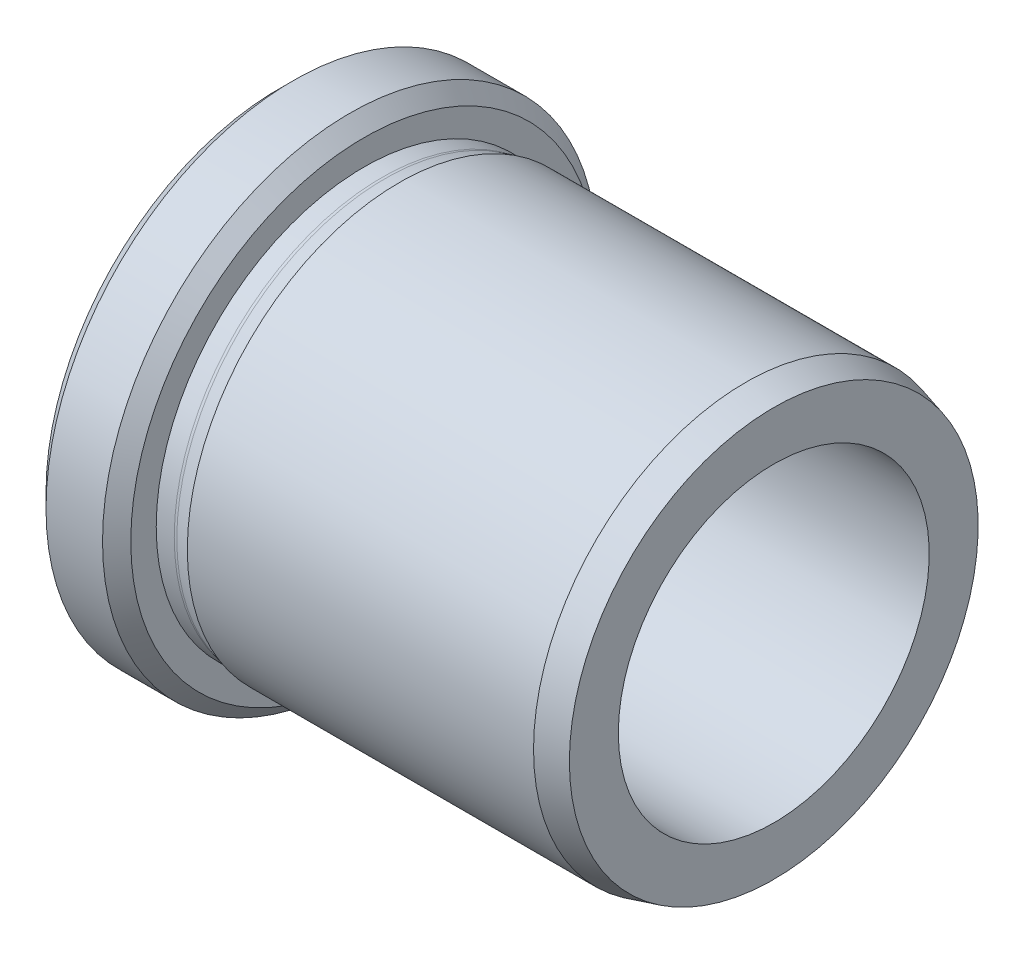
ISO-10303-21;
HEADER;
FILE_DESCRIPTION(('STEP AP214'),'2;1');
FILE_NAME('part.step','',(''),(''),'','','');
FILE_SCHEMA(('AUTOMOTIVE_DESIGN { 1 0 10303 214 1 1 1 1 }'));
ENDSEC;
DATA;
#1=APPLICATION_CONTEXT('core data for automotive mechanical design processes');
#2=APPLICATION_PROTOCOL_DEFINITION('international standard','automotive_design',2000,#1);
#3=PRODUCT_CONTEXT('',#1,'mechanical');
#4=PRODUCT('Part','Part','',(#3));
#5=PRODUCT_RELATED_PRODUCT_CATEGORY('part','',(#4));
#6=PRODUCT_DEFINITION_FORMATION('','',#4);
#7=PRODUCT_DEFINITION_CONTEXT('part definition',#1,'design');
#8=PRODUCT_DEFINITION('design','',#6,#7);
#9=PRODUCT_DEFINITION_SHAPE('','',#8);
#10=(LENGTH_UNIT() NAMED_UNIT(*) SI_UNIT(.MILLI.,.METRE.));
#11=(NAMED_UNIT(*) PLANE_ANGLE_UNIT() SI_UNIT($,.RADIAN.));
#12=(NAMED_UNIT(*) SI_UNIT($,.STERADIAN.) SOLID_ANGLE_UNIT());
#13=UNCERTAINTY_MEASURE_WITH_UNIT(LENGTH_MEASURE(1.E-05),#10,'distance_accuracy_value','');
#14=(GEOMETRIC_REPRESENTATION_CONTEXT(3) GLOBAL_UNCERTAINTY_ASSIGNED_CONTEXT((#13)) GLOBAL_UNIT_ASSIGNED_CONTEXT((#10,
#11,#12)) REPRESENTATION_CONTEXT('',''));
#15=CARTESIAN_POINT('',(0.,0.,0.));
#16=DIRECTION('',(0.,0.,1.));
#17=DIRECTION('',(1.,0.,0.));
#18=AXIS2_PLACEMENT_3D('',#15,#16,#17);
#19=CARTESIAN_POINT('',(18.075539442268,0.,0.));
#20=DIRECTION('',(-1.,0.,0.));
#21=DIRECTION('',(0.,0.,1.));
#22=AXIS2_PLACEMENT_3D('',#19,#20,#21);
#23=TOROIDAL_SURFACE('',#22,15.5,0.8);
#24=CARTESIAN_POINT('',(18.075539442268,0.,0.));
#25=DIRECTION('',(-1.,0.,0.));
#26=DIRECTION('',(0.,0.,1.));
#27=AXIS2_PLACEMENT_3D('',#24,#25,#26);
#28=CIRCLE('',#27,14.7);
#29=CARTESIAN_POINT('',(18.075539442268,0.,14.7));
#30=VERTEX_POINT('',#29);
#31=EDGE_CURVE('E58',#30,#30,#28,.T.);
#32=ORIENTED_EDGE('',*,*,#31,.F.);
#33=EDGE_LOOP('',(#32));
#34=FACE_BOUND('',#33,.T.);
#35=CARTESIAN_POINT('',(18.28259467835,0.,0.));
#36=DIRECTION('',(-1.,0.,0.));
#37=DIRECTION('',(0.,0.,1.));
#38=AXIS2_PLACEMENT_3D('',#35,#36,#37);
#39=CIRCLE('',#38,14.7272593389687);
#40=CARTESIAN_POINT('',(18.28259467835,0.,14.7272593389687));
#41=VERTEX_POINT('',#40);
#42=EDGE_CURVE('E40',#41,#41,#39,.T.);
#43=ORIENTED_EDGE('',*,*,#42,.T.);
#44=EDGE_LOOP('',(#43));
#45=FACE_BOUND('',#44,.T.);
#46=ADVANCED_FACE('F14',(#34,#45),#23,.F.);
#47=CARTESIAN_POINT('',(19.3004766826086,0.,0.));
#48=DIRECTION('',(1.,0.,0.));
#49=DIRECTION('',(0.,0.,-1.));
#50=AXIS2_PLACEMENT_3D('',#47,#48,#49);
#51=CONICAL_SURFACE('',#50,15.,0.261799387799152);
#52=ORIENTED_EDGE('',*,*,#42,.F.);
#53=EDGE_LOOP('',(#52));
#54=FACE_BOUND('',#53,.T.);
#55=CARTESIAN_POINT('',(19.3004766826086,0.,0.));
#56=DIRECTION('',(-1.,0.,0.));
#57=DIRECTION('',(0.,0.,1.));
#58=AXIS2_PLACEMENT_3D('',#55,#56,#57);
#59=CIRCLE('',#58,15.);
#60=CARTESIAN_POINT('',(19.3004766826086,0.,15.));
#61=VERTEX_POINT('',#60);
#62=EDGE_CURVE('E43',#61,#61,#59,.T.);
#63=ORIENTED_EDGE('',*,*,#62,.T.);
#64=EDGE_LOOP('',(#63));
#65=FACE_BOUND('',#64,.T.);
#66=ADVANCED_FACE('F66',(#54,#65),#51,.T.);
#67=CARTESIAN_POINT('',(0.,0.,0.));
#68=DIRECTION('',(-1.,0.,0.));
#69=DIRECTION('',(0.,0.,1.));
#70=AXIS2_PLACEMENT_3D('',#67,#68,#69);
#71=CYLINDRICAL_SURFACE('',#70,15.);
#72=ORIENTED_EDGE('',*,*,#62,.F.);
#73=EDGE_LOOP('',(#72));
#74=FACE_BOUND('',#73,.T.);
#75=CARTESIAN_POINT('',(43.8004766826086,0.,0.));
#76=DIRECTION('',(-1.,0.,0.));
#77=DIRECTION('',(0.,0.,1.));
#78=AXIS2_PLACEMENT_3D('',#75,#76,#77);
#79=CIRCLE('',#78,15.);
#80=CARTESIAN_POINT('',(43.8004766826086,0.,15.));
#81=VERTEX_POINT('',#80);
#82=EDGE_CURVE('E46',#81,#81,#79,.T.);
#83=ORIENTED_EDGE('',*,*,#82,.T.);
#84=EDGE_LOOP('',(#83));
#85=FACE_BOUND('',#84,.T.);
#86=ADVANCED_FACE('F72',(#74,#85),#71,.T.);
#87=CARTESIAN_POINT('',(45.8004766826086,0.,0.));
#88=DIRECTION('',(-1.,0.,0.));
#89=DIRECTION('',(0.,0.,1.));
#90=AXIS2_PLACEMENT_3D('',#87,#88,#89);
#91=CONICAL_SURFACE('',#90,14.4641016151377,0.26179938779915);
#92=ORIENTED_EDGE('',*,*,#82,.F.);
#93=EDGE_LOOP('',(#92));
#94=FACE_BOUND('',#93,.T.);
#95=CARTESIAN_POINT('',(45.8004766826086,0.,0.));
#96=DIRECTION('',(-1.,0.,0.));
#97=DIRECTION('',(0.,0.,1.));
#98=AXIS2_PLACEMENT_3D('',#95,#96,#97);
#99=CIRCLE('',#98,14.4641016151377);
#100=CARTESIAN_POINT('',(45.8004766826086,0.,14.4641016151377));
#101=VERTEX_POINT('',#100);
#102=EDGE_CURVE('E49',#101,#101,#99,.T.);
#103=ORIENTED_EDGE('',*,*,#102,.T.);
#104=EDGE_LOOP('',(#103));
#105=FACE_BOUND('',#104,.T.);
#106=ADVANCED_FACE('F78',(#94,#105),#91,.T.);
#107=CARTESIAN_POINT('',(45.8004766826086,14.4641016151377,0.));
#108=DIRECTION('',(-1.,0.,0.));
#109=DIRECTION('',(0.,0.,1.));
#110=AXIS2_PLACEMENT_3D('',#107,#108,#109);
#111=PLANE('',#110);
#112=ORIENTED_EDGE('',*,*,#102,.F.);
#113=EDGE_LOOP('',(#112));
#114=FACE_BOUND('',#113,.T.);
#115=CARTESIAN_POINT('',(45.8004766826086,0.,0.));
#116=DIRECTION('',(-1.,0.,0.));
#117=DIRECTION('',(0.,0.,1.));
#118=AXIS2_PLACEMENT_3D('',#115,#116,#117);
#119=CIRCLE('',#118,11.);
#120=CARTESIAN_POINT('',(45.8004766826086,0.,11.));
#121=VERTEX_POINT('',#120);
#122=EDGE_CURVE('E52',#121,#121,#119,.T.);
#123=ORIENTED_EDGE('',*,*,#122,.T.);
#124=EDGE_LOOP('',(#123));
#125=FACE_BOUND('',#124,.T.);
#126=ADVANCED_FACE('F84',(#114,#125),#111,.F.);
#127=CARTESIAN_POINT('',(0.,0.,0.));
#128=DIRECTION('',(-1.,0.,0.));
#129=DIRECTION('',(0.,0.,1.));
#130=AXIS2_PLACEMENT_3D('',#127,#128,#129);
#131=CYLINDRICAL_SURFACE('',#130,11.);
#132=CARTESIAN_POINT('',(12.3004766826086,0.,0.));
#133=DIRECTION('',(1.,0.,0.));
#134=DIRECTION('',(0.,0.,-1.));
#135=AXIS2_PLACEMENT_3D('',#132,#133,#134);
#136=CIRCLE('',#135,11.);
#137=CARTESIAN_POINT('',(12.3004766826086,0.,-11.));
#138=VERTEX_POINT('',#137);
#139=EDGE_CURVE('E29',#138,#138,#136,.F.);
#140=ORIENTED_EDGE('',*,*,#139,.T.);
#141=EDGE_LOOP('',(#140));
#142=FACE_BOUND('',#141,.T.);
#143=ORIENTED_EDGE('',*,*,#122,.F.);
#144=EDGE_LOOP('',(#143));
#145=FACE_BOUND('',#144,.T.);
#146=ADVANCED_FACE('F90',(#142,#145),#131,.F.);
#147=CARTESIAN_POINT('',(10.8004766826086,17.5,0.));
#148=DIRECTION('',(1.,0.,0.));
#149=DIRECTION('',(0.,0.,-1.));
#150=AXIS2_PLACEMENT_3D('',#147,#148,#149);
#151=PLANE('',#150);
#152=CARTESIAN_POINT('',(10.8004766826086,0.,0.));
#153=DIRECTION('',(1.,0.,0.));
#154=DIRECTION('',(0.,0.,-1.));
#155=AXIS2_PLACEMENT_3D('',#152,#153,#154);
#156=CIRCLE('',#155,12.5);
#157=CARTESIAN_POINT('',(10.8004766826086,0.,-12.5));
#158=VERTEX_POINT('',#157);
#159=EDGE_CURVE('E25',#158,#158,#156,.T.);
#160=ORIENTED_EDGE('',*,*,#159,.T.);
#161=EDGE_LOOP('',(#160));
#162=FACE_BOUND('',#161,.T.);
#163=CARTESIAN_POINT('',(10.8004766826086,0.,0.));
#164=DIRECTION('',(1.,0.,0.));
#165=DIRECTION('',(0.,0.,-1.));
#166=AXIS2_PLACEMENT_3D('',#163,#164,#165);
#167=CIRCLE('',#166,16.5);
#168=CARTESIAN_POINT('',(10.8004766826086,0.,-16.5));
#169=VERTEX_POINT('',#168);
#170=EDGE_CURVE('E37',#169,#169,#167,.F.);
#171=ORIENTED_EDGE('',*,*,#170,.T.);
#172=EDGE_LOOP('',(#171));
#173=FACE_BOUND('',#172,.T.);
#174=ADVANCED_FACE('F95',(#162,#173),#151,.F.);
#175=CARTESIAN_POINT('',(0.,0.,0.));
#176=DIRECTION('',(-1.,0.,0.));
#177=DIRECTION('',(0.,0.,1.));
#178=AXIS2_PLACEMENT_3D('',#175,#176,#177);
#179=CYLINDRICAL_SURFACE('',#178,17.5);
#180=CARTESIAN_POINT('',(15.8004766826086,0.,0.));
#181=DIRECTION('',(-1.,0.,0.));
#182=DIRECTION('',(0.,0.,1.));
#183=AXIS2_PLACEMENT_3D('',#180,#181,#182);
#184=CIRCLE('',#183,17.5);
#185=CARTESIAN_POINT('',(15.8004766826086,0.,17.5));
#186=VERTEX_POINT('',#185);
#187=EDGE_CURVE('E21',#186,#186,#184,.T.);
#188=ORIENTED_EDGE('',*,*,#187,.T.);
#189=EDGE_LOOP('',(#188));
#190=FACE_BOUND('',#189,.T.);
#191=CARTESIAN_POINT('',(11.8004766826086,0.,0.));
#192=DIRECTION('',(1.,0.,0.));
#193=DIRECTION('',(0.,0.,-1.));
#194=AXIS2_PLACEMENT_3D('',#191,#192,#193);
#195=CIRCLE('',#194,17.5);
#196=CARTESIAN_POINT('',(11.8004766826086,0.,-17.5));
#197=VERTEX_POINT('',#196);
#198=EDGE_CURVE('E34',#197,#197,#195,.T.);
#199=ORIENTED_EDGE('',*,*,#198,.T.);
#200=EDGE_LOOP('',(#199));
#201=FACE_BOUND('',#200,.T.);
#202=ADVANCED_FACE('F103',(#190,#201),#179,.T.);
#203=CARTESIAN_POINT('',(16.8004766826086,17.5,0.));
#204=DIRECTION('',(-1.,0.,0.));
#205=DIRECTION('',(0.,0.,1.));
#206=AXIS2_PLACEMENT_3D('',#203,#204,#205);
#207=PLANE('',#206);
#208=CARTESIAN_POINT('',(16.8004766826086,0.,0.));
#209=DIRECTION('',(-1.,0.,0.));
#210=DIRECTION('',(0.,0.,1.));
#211=AXIS2_PLACEMENT_3D('',#208,#209,#210);
#212=CIRCLE('',#211,16.5);
#213=CARTESIAN_POINT('',(16.8004766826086,0.,16.5));
#214=VERTEX_POINT('',#213);
#215=EDGE_CURVE('E9',#214,#214,#212,.F.);
#216=ORIENTED_EDGE('',*,*,#215,.T.);
#217=EDGE_LOOP('',(#216));
#218=FACE_BOUND('',#217,.T.);
#219=CARTESIAN_POINT('',(16.8004766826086,0.,0.));
#220=DIRECTION('',(-1.,0.,0.));
#221=DIRECTION('',(0.,0.,1.));
#222=AXIS2_PLACEMENT_3D('',#219,#220,#221);
#223=CIRCLE('',#222,14.7);
#224=CARTESIAN_POINT('',(16.8004766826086,0.,14.7));
#225=VERTEX_POINT('',#224);
#226=EDGE_CURVE('E55',#225,#225,#223,.T.);
#227=ORIENTED_EDGE('',*,*,#226,.T.);
#228=EDGE_LOOP('',(#227));
#229=FACE_BOUND('',#228,.T.);
#230=ADVANCED_FACE('F142',(#218,#229),#207,.F.);
#231=CARTESIAN_POINT('',(0.,0.,0.));
#232=DIRECTION('',(-1.,0.,0.));
#233=DIRECTION('',(0.,0.,1.));
#234=AXIS2_PLACEMENT_3D('',#231,#232,#233);
#235=CYLINDRICAL_SURFACE('',#234,14.7);
#236=ORIENTED_EDGE('',*,*,#226,.F.);
#237=EDGE_LOOP('',(#236));
#238=FACE_BOUND('',#237,.T.);
#239=ORIENTED_EDGE('',*,*,#31,.T.);
#240=EDGE_LOOP('',(#239));
#241=FACE_BOUND('',#240,.T.);
#242=ADVANCED_FACE('F62',(#238,#241),#235,.T.);
#243=CARTESIAN_POINT('',(10.8004766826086,0.,0.));
#244=DIRECTION('',(1.,0.,0.));
#245=DIRECTION('',(0.,0.,-1.));
#246=AXIS2_PLACEMENT_3D('',#243,#244,#245);
#247=CONICAL_SURFACE('',#246,16.5,0.785398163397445);
#248=ORIENTED_EDGE('',*,*,#198,.F.);
#249=EDGE_LOOP('',(#248));
#250=FACE_BOUND('',#249,.T.);
#251=ORIENTED_EDGE('',*,*,#170,.F.);
#252=EDGE_LOOP('',(#251));
#253=FACE_BOUND('',#252,.T.);
#254=ADVANCED_FACE('F108',(#250,#253),#247,.T.);
#255=CARTESIAN_POINT('',(12.3004766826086,0.,0.));
#256=DIRECTION('',(1.,0.,0.));
#257=DIRECTION('',(0.,0.,-1.));
#258=AXIS2_PLACEMENT_3D('',#255,#256,#257);
#259=TOROIDAL_SURFACE('',#258,12.5,1.5);
#260=ORIENTED_EDGE('',*,*,#159,.F.);
#261=EDGE_LOOP('',(#260));
#262=FACE_BOUND('',#261,.T.);
#263=ORIENTED_EDGE('',*,*,#139,.F.);
#264=EDGE_LOOP('',(#263));
#265=FACE_BOUND('',#264,.T.);
#266=ADVANCED_FACE('F110',(#262,#265),#259,.T.);
#267=CARTESIAN_POINT('',(15.8004766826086,0.,0.));
#268=DIRECTION('',(-1.,0.,0.));
#269=DIRECTION('',(0.,0.,1.));
#270=AXIS2_PLACEMENT_3D('',#267,#268,#269);
#271=CONICAL_SURFACE('',#270,17.5,0.785398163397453);
#272=ORIENTED_EDGE('',*,*,#215,.F.);
#273=EDGE_LOOP('',(#272));
#274=FACE_BOUND('',#273,.T.);
#275=ORIENTED_EDGE('',*,*,#187,.F.);
#276=EDGE_LOOP('',(#275));
#277=FACE_BOUND('',#276,.T.);
#278=ADVANCED_FACE('F16',(#274,#277),#271,.T.);
#279=CLOSED_SHELL('',(#46,#66,#86,#106,#126,#146,#174,#202,#230,#242,#254,#266,#278));
#280=MANIFOLD_SOLID_BREP('B1',#279);
#281=ADVANCED_BREP_SHAPE_REPRESENTATION('',(#18,#280),#14);
#282=SHAPE_DEFINITION_REPRESENTATION(#9,#281);
ENDSEC;
END-ISO-10303-21;
